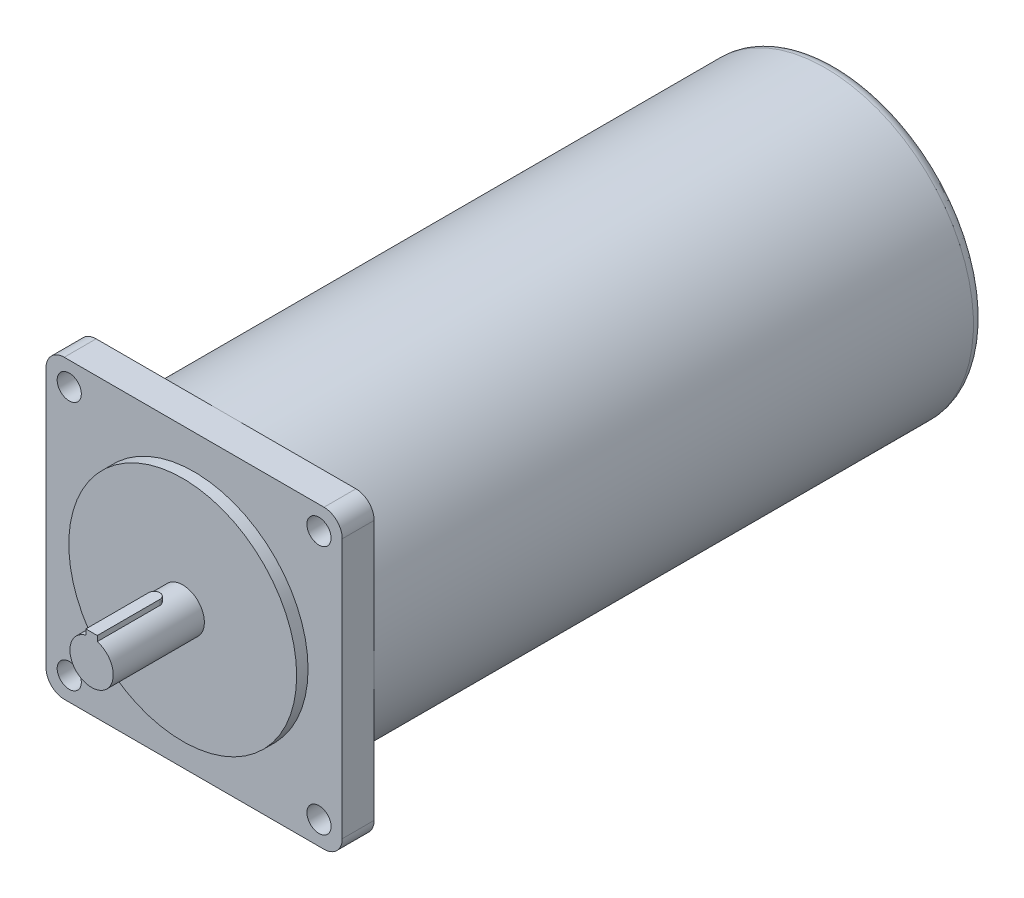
from build123d import *

# Parameters (mm, degrees)
SKETCH_1_R      = 50
EXTRUDE_1_DEPTH = 5
SKETCH_2_R      = 9.5
EXTRUDE_2_DEPTH = 40
EXTRUDE_3_DEPTH = 11.5
SKETCH_4_R      = 5.3
EXTRUDE_4_DEPTH = 14
SKETCH_6_R      = 65
EXTRUDE_5_DEPTH = 268
FILLET_1_R      = 5


with BuildPart() as part:
    # Sketch 1 → Extrude 1 (new body)
    with BuildSketch(Plane.XY):
        Circle(SKETCH_1_R)
    extrude(amount=-EXTRUDE_1_DEPTH)

    # Sketch 2 → Extrude 2 (add)
    with BuildSketch(Plane.XY):
        Circle(SKETCH_2_R)
    extrude(amount=EXTRUDE_2_DEPTH)

    # Sketch 3 → Extrude 3 (add)
    with BuildSketch(Plane(origin=(0, 0, 0), x_dir=(1, 0, 0), z_dir=(0, 1, 0))):
        with BuildLine():
            Line((-2.5, -12.5), (-2.5, -40))
            Line((-2.5, -40), (2.5, -40))
            Line((2.5, -40), (2.5, -12.5))
            ThreePointArc((2.5, -12.5), (0, -10), (-2.5, -12.5))
        make_face()
    extrude(amount=EXTRUDE_3_DEPTH)

    # Sketch 4 → Extrude 4 (add)
    with BuildSketch(Plane(origin=(0, 0, -5), x_dir=(-1, 0, 0), z_dir=(0, 0, -1))):
        with BuildLine():
            Line((0, 65), (57, 65))
            ThreePointArc((57, 65), (62.656854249, 62.656854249), (65, 57))
            Line((65, 57), (65, -57))
            ThreePointArc((65, -57), (62.656854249, -62.656854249), (57, -65))
            Line((57, -65), (-57, -65))
            ThreePointArc((-57, -65), (-62.656854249, -62.656854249), (-65, -57))
            Line((-65, -57), (-65, 57))
            ThreePointArc((-65, 57), (-62.656854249, 62.656854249), (-57, 65))
            Line((-57, 65), (0, 65))
        make_face()
        with Locations((-54.8, 54.8)):
            Circle(SKETCH_4_R, mode=Mode.SUBTRACT)
        with Locations((54.8, 54.8)):
            Circle(SKETCH_4_R, mode=Mode.SUBTRACT)
        with Locations((54.8, -54.8)):
            Circle(SKETCH_4_R, mode=Mode.SUBTRACT)
        with Locations((-54.8, -54.8)):
            Circle(SKETCH_4_R, mode=Mode.SUBTRACT)
    extrude(amount=EXTRUDE_4_DEPTH)

    # Sketch 6 → Extrude 5 (add)
    with BuildSketch(Plane(origin=(0, 0, -19), x_dir=(-1, 0, 0), z_dir=(0, 0, -1))):
        Circle(SKETCH_6_R)
    extrude(amount=EXTRUDE_5_DEPTH)

    # Fillet 1
    fillet_1_edges = [part.edges().sort_by_distance(p)[0] for p in [
        (65, 0, -287),
    ]]
    fillet(fillet_1_edges, radius=FILLET_1_R)


solid = part.part
